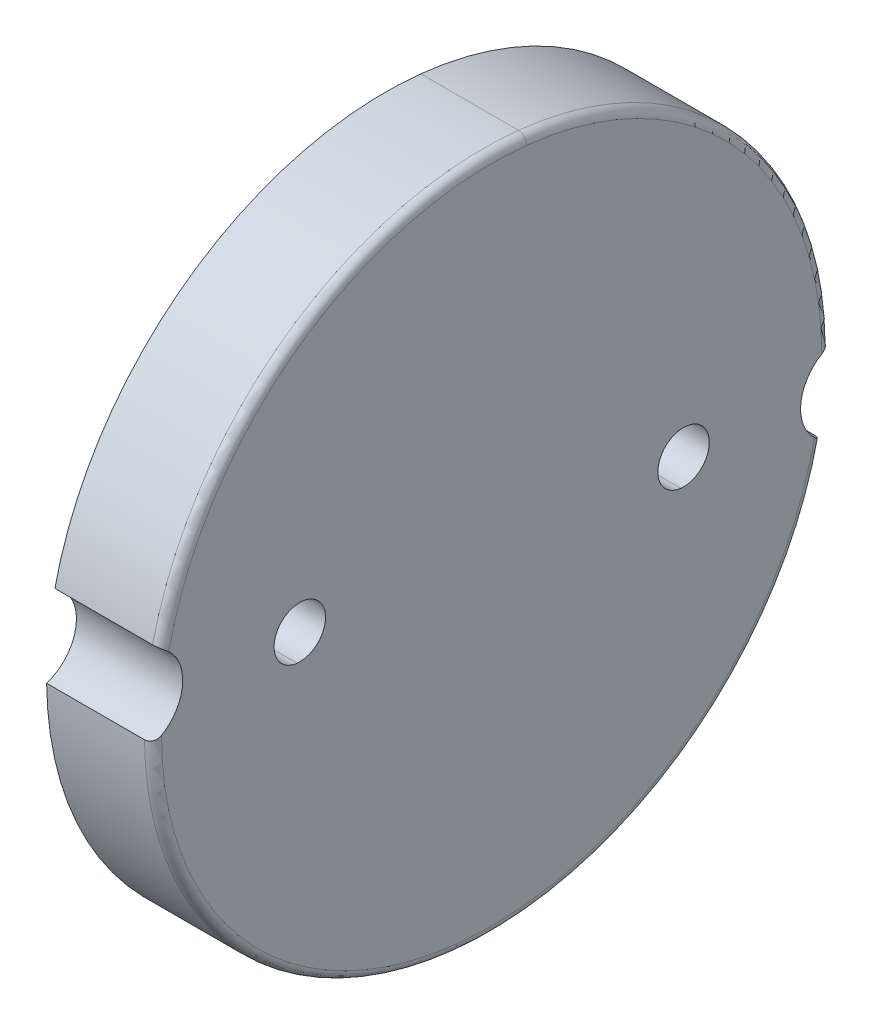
ISO-10303-21;
HEADER;
FILE_DESCRIPTION(('STEP AP214'),'2;1');
FILE_NAME('part.step','',(''),(''),'','','');
FILE_SCHEMA(('AUTOMOTIVE_DESIGN { 1 0 10303 214 1 1 1 1 }'));
ENDSEC;
DATA;
#1=APPLICATION_CONTEXT('core data for automotive mechanical design processes');
#2=APPLICATION_PROTOCOL_DEFINITION('international standard','automotive_design',2000,#1);
#3=PRODUCT_CONTEXT('',#1,'mechanical');
#4=PRODUCT('Part','Part','',(#3));
#5=PRODUCT_RELATED_PRODUCT_CATEGORY('part','',(#4));
#6=PRODUCT_DEFINITION_FORMATION('','',#4);
#7=PRODUCT_DEFINITION_CONTEXT('part definition',#1,'design');
#8=PRODUCT_DEFINITION('design','',#6,#7);
#9=PRODUCT_DEFINITION_SHAPE('','',#8);
#10=(LENGTH_UNIT() NAMED_UNIT(*) SI_UNIT(.MILLI.,.METRE.));
#11=(NAMED_UNIT(*) PLANE_ANGLE_UNIT() SI_UNIT($,.RADIAN.));
#12=(NAMED_UNIT(*) SI_UNIT($,.STERADIAN.) SOLID_ANGLE_UNIT());
#13=UNCERTAINTY_MEASURE_WITH_UNIT(LENGTH_MEASURE(1.E-05),#10,'distance_accuracy_value','');
#14=(GEOMETRIC_REPRESENTATION_CONTEXT(3) GLOBAL_UNCERTAINTY_ASSIGNED_CONTEXT((#13)) GLOBAL_UNIT_ASSIGNED_CONTEXT((#10,
#11,#12)) REPRESENTATION_CONTEXT('',''));
#15=CARTESIAN_POINT('',(0.,0.,0.));
#16=DIRECTION('',(0.,0.,1.));
#17=DIRECTION('',(1.,0.,0.));
#18=AXIS2_PLACEMENT_3D('',#15,#16,#17);
#19=CARTESIAN_POINT('',(77.46,-0.4703780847,-4.4753485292));
#20=DIRECTION('',(-1.,0.,0.));
#21=DIRECTION('',(0.,-0.994521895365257,0.104528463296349));
#22=AXIS2_PLACEMENT_3D('',#19,#20,#21);
#23=CYLINDRICAL_SURFACE('',#22,0.6);
#24=DIRECTION('',(1.,0.,0.));
#25=VECTOR('',#24,1.);
#26=CARTESIAN_POINT('',(83.61,-1.06709122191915,-4.41263145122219));
#27=LINE('',#26,#25);
#28=CARTESIAN_POINT('',(82.37,-1.06709122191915,-4.41263145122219));
#29=VERTEX_POINT('',#28);
#30=CARTESIAN_POINT('',(84.85,-1.06709122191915,-4.41263145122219));
#31=VERTEX_POINT('',#30);
#32=EDGE_CURVE('E41',#29,#31,#27,.T.);
#33=ORIENTED_EDGE('',*,*,#32,.F.);
#34=CARTESIAN_POINT('',(82.37,-0.4703780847,-4.4753485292));
#35=DIRECTION('',(1.,0.,0.));
#36=DIRECTION('',(0.,-0.994521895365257,0.104528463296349));
#37=AXIS2_PLACEMENT_3D('',#34,#35,#36);
#38=CIRCLE('',#37,0.6);
#39=CARTESIAN_POINT('',(82.37,0.126335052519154,-4.53806560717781));
#40=VERTEX_POINT('',#39);
#41=EDGE_CURVE('E212',#40,#29,#38,.T.);
#42=ORIENTED_EDGE('',*,*,#41,.F.);
#43=DIRECTION('',(-1.,0.,0.));
#44=VECTOR('',#43,1.);
#45=CARTESIAN_POINT('',(83.61,0.126335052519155,-4.53806560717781));
#46=LINE('',#45,#44);
#47=CARTESIAN_POINT('',(84.85,0.126335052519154,-4.53806560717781));
#48=VERTEX_POINT('',#47);
#49=EDGE_CURVE('E269',#48,#40,#46,.T.);
#50=ORIENTED_EDGE('',*,*,#49,.F.);
#51=CARTESIAN_POINT('',(84.85,-0.4703780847,-4.4753485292));
#52=DIRECTION('',(-1.,0.,0.));
#53=DIRECTION('',(0.,-0.994521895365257,0.104528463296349));
#54=AXIS2_PLACEMENT_3D('',#51,#52,#53);
#55=CIRCLE('',#54,0.6);
#56=EDGE_CURVE('E226',#31,#48,#55,.T.);
#57=ORIENTED_EDGE('',*,*,#56,.F.);
#58=EDGE_LOOP('',(#33,#42,#50,#57));
#59=FACE_BOUND('',#58,.T.);
#60=ADVANCED_FACE('F16',(#59),#23,.F.);
#61=CARTESIAN_POINT('',(77.46,0.4703780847,4.4753485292));
#62=DIRECTION('',(-1.,0.,0.));
#63=DIRECTION('',(0.,0.994521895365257,-0.104528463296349));
#64=AXIS2_PLACEMENT_3D('',#61,#62,#63);
#65=CYLINDRICAL_SURFACE('',#64,0.6);
#66=DIRECTION('',(1.,0.,0.));
#67=VECTOR('',#66,1.);
#68=CARTESIAN_POINT('',(83.61,1.06709122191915,4.41263145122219));
#69=LINE('',#68,#67);
#70=CARTESIAN_POINT('',(82.37,1.06709122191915,4.41263145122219));
#71=VERTEX_POINT('',#70);
#72=CARTESIAN_POINT('',(84.85,1.06709122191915,4.41263145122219));
#73=VERTEX_POINT('',#72);
#74=EDGE_CURVE('E220',#71,#73,#69,.T.);
#75=ORIENTED_EDGE('',*,*,#74,.F.);
#76=CARTESIAN_POINT('',(82.37,0.4703780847,4.4753485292));
#77=DIRECTION('',(1.,0.,0.));
#78=DIRECTION('',(0.,0.994521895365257,-0.104528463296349));
#79=AXIS2_PLACEMENT_3D('',#76,#77,#78);
#80=CIRCLE('',#79,0.6);
#81=CARTESIAN_POINT('',(82.37,-0.126335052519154,4.53806560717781));
#82=VERTEX_POINT('',#81);
#83=EDGE_CURVE('E213',#82,#71,#80,.T.);
#84=ORIENTED_EDGE('',*,*,#83,.F.);
#85=DIRECTION('',(-1.,0.,0.));
#86=VECTOR('',#85,1.);
#87=CARTESIAN_POINT('',(83.61,-0.126335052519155,4.53806560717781));
#88=LINE('',#87,#86);
#89=CARTESIAN_POINT('',(84.85,-0.126335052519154,4.53806560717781));
#90=VERTEX_POINT('',#89);
#91=EDGE_CURVE('E232',#90,#82,#88,.T.);
#92=ORIENTED_EDGE('',*,*,#91,.F.);
#93=CARTESIAN_POINT('',(84.85,0.4703780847,4.4753485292));
#94=DIRECTION('',(-1.,0.,0.));
#95=DIRECTION('',(0.,0.994521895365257,-0.104528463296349));
#96=AXIS2_PLACEMENT_3D('',#93,#94,#95);
#97=CIRCLE('',#96,0.6);
#98=EDGE_CURVE('E235',#73,#90,#97,.T.);
#99=ORIENTED_EDGE('',*,*,#98,.F.);
#100=EDGE_LOOP('',(#75,#84,#92,#99));
#101=FACE_BOUND('',#100,.T.);
#102=ADVANCED_FACE('F315',(#101),#65,.F.);
#103=CARTESIAN_POINT('',(84.6499999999,0.,0.));
#104=DIRECTION('',(-1.,0.,0.));
#105=DIRECTION('',(0.,-0.994521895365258,0.104528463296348));
#106=AXIS2_PLACEMENT_3D('',#103,#104,#105);
#107=TOROIDAL_SURFACE('',#106,7.6999999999,0.200000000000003);
#108=CARTESIAN_POINT('',(84.6499999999,-7.65781859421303,0.804869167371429));
#109=DIRECTION('',(0.,0.104528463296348,0.994521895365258));
#110=DIRECTION('',(0.,-0.994521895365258,0.104528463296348));
#111=AXIS2_PLACEMENT_3D('',#108,#109,#110);
#112=CIRCLE('',#111,0.200000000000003);
#113=CARTESIAN_POINT('',(84.6499999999,-7.85672297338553,0.825774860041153));
#114=VERTEX_POINT('',#113);
#115=CARTESIAN_POINT('',(84.85,-7.65781859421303,0.804869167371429));
#116=VERTEX_POINT('',#115);
#117=EDGE_CURVE('E258',#114,#116,#112,.T.);
#118=ORIENTED_EDGE('',*,*,#117,.F.);
#119=CARTESIAN_POINT('',(84.6499999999,0.,0.));
#120=DIRECTION('',(1.,0.,0.));
#121=DIRECTION('',(0.,-0.994521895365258,0.104528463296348));
#122=AXIS2_PLACEMENT_3D('',#119,#120,#121);
#123=CIRCLE('',#122,7.9);
#124=CARTESIAN_POINT('',(84.6499999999,-1.73032261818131,-7.70817641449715));
#125=VERTEX_POINT('',#124);
#126=EDGE_CURVE('E11',#114,#125,#123,.T.);
#127=ORIENTED_EDGE('',*,*,#126,.T.);
#128=CARTESIAN_POINT('',(84.65,-1.73032261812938,-7.70817641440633));
#129=CARTESIAN_POINT('',(84.65356289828,-1.7303226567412,-7.70817654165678));
#130=CARTESIAN_POINT('',(84.6571257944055,-1.73027416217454,-7.70808972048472));
#131=CARTESIAN_POINT('',(84.6642192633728,-1.73007993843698,-7.70774435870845));
#132=CARTESIAN_POINT('',(84.6677499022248,-1.72993479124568,-7.70748684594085));
#133=CARTESIAN_POINT('',(84.6747691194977,-1.72954822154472,-7.70680421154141));
#134=CARTESIAN_POINT('',(84.6782578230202,-1.72930735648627,-7.70638006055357));
#135=CARTESIAN_POINT('',(84.6851838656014,-1.72873049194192,-7.70536889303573));
#136=CARTESIAN_POINT('',(84.6886213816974,-1.72839502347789,-7.70478278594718));
#137=CARTESIAN_POINT('',(84.6954361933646,-1.72763019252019,-7.70345280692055));
#138=CARTESIAN_POINT('',(84.6988137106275,-1.72720133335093,-7.70270978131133));
#139=CARTESIAN_POINT('',(84.7055001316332,-1.72625107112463,-7.70107145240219));
#140=CARTESIAN_POINT('',(84.7088092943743,-1.72573014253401,-7.70017693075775));
#141=CARTESIAN_POINT('',(84.7153510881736,-1.72459718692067,-7.69824143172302));
#142=CARTESIAN_POINT('',(84.7185840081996,-1.72398560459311,-7.6972011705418));
#143=CARTESIAN_POINT('',(84.7249658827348,-1.72267287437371,-7.69498031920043));
#144=CARTESIAN_POINT('',(84.7281151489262,-1.72197214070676,-7.69380037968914));
#145=CARTESIAN_POINT('',(84.7343227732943,-1.72048271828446,-7.69130656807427));
#146=CARTESIAN_POINT('',(84.737381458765,-1.71969441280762,-7.6899932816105));
#147=CARTESIAN_POINT('',(84.7434014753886,-1.7180315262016,-7.6872394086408));
#148=CARTESIAN_POINT('',(84.7463631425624,-1.71715729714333,-7.6857993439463));
#149=CARTESIAN_POINT('',(84.7521831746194,-1.7153243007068,-7.68279875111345));
#150=CARTESIAN_POINT('',(84.7550418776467,-1.71436585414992,-7.6812386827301));
#151=CARTESIAN_POINT('',(84.7606505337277,-1.71236621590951,-7.67800508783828));
#152=CARTESIAN_POINT('',(84.7634008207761,-1.71132531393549,-7.67633196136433));
#153=CARTESIAN_POINT('',(84.7687876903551,-1.70916257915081,-7.67287940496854));
#154=CARTESIAN_POINT('',(84.7714245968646,-1.70804100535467,-7.67110031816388));
#155=CARTESIAN_POINT('',(84.7765802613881,-1.70571884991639,-7.66744307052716));
#156=CARTESIAN_POINT('',(84.7790993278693,-1.70451849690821,-7.66556519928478));
#157=CARTESIAN_POINT('',(84.7840152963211,-1.70204044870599,-7.6617178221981));
#158=CARTESIAN_POINT('',(84.7864124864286,-1.70076295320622,-7.65974855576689));
#159=CARTESIAN_POINT('',(84.7910813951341,-1.69813334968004,-7.65572539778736));
#160=CARTESIAN_POINT('',(84.7933533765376,-1.69678141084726,-7.65367170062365));
#161=CARTESIAN_POINT('',(84.7976884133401,-1.69405199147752,-7.64956410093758));
#162=CARTESIAN_POINT('',(84.7997561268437,-1.69267743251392,-7.64751317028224));
#163=CARTESIAN_POINT('',(84.8037882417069,-1.68984483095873,-7.64332845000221));
#164=CARTESIAN_POINT('',(84.8057516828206,-1.68838620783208,-7.64119412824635));
#165=CARTESIAN_POINT('',(84.8095704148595,-1.68538751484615,-7.6368465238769));
#166=CARTESIAN_POINT('',(84.8114246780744,-1.68384687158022,-7.63463273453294));
#167=CARTESIAN_POINT('',(84.8150201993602,-1.68068522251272,-7.63013078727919));
#168=CARTESIAN_POINT('',(84.8167603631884,-1.67906364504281,-7.62784215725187));
#169=CARTESIAN_POINT('',(84.8201230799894,-1.67574154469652,-7.62319524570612));
#170=CARTESIAN_POINT('',(84.8217444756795,-1.67404045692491,-7.62083653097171));
#171=CARTESIAN_POINT('',(84.8248652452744,-1.67056073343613,-7.61605443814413));
#172=CARTESIAN_POINT('',(84.8263634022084,-1.66878154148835,-7.61363067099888));
#173=CARTESIAN_POINT('',(84.8292335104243,-1.66514707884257,-7.60872368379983));
#174=CARTESIAN_POINT('',(84.8306041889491,-1.66329126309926,-7.6062401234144));
#175=CARTESIAN_POINT('',(84.8332153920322,-1.65950506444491,-7.60121898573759));
#176=CARTESIAN_POINT('',(84.8344545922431,-1.65757414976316,-7.59868112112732));
#177=CARTESIAN_POINT('',(84.8367991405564,-1.65363931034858,-7.59355702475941));
#178=CARTESIAN_POINT('',(84.8379031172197,-1.65163486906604,-7.59097056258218));
#179=CARTESIAN_POINT('',(84.8399737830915,-1.64755457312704,-7.58575512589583));
#180=CARTESIAN_POINT('',(84.8409390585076,-1.64547821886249,-7.58312598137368));
#181=CARTESIAN_POINT('',(84.8427291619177,-1.64125572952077,-7.57783122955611));
#182=CARTESIAN_POINT('',(84.8435525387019,-1.6391091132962,-7.57516551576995));
#183=CARTESIAN_POINT('',(84.8450559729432,-1.63474776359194,-7.56980385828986));
#184=CARTESIAN_POINT('',(84.8457345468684,-1.63253256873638,-7.56710787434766));
#185=CARTESIAN_POINT('',(84.8469458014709,-1.62803575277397,-7.56169208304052));
#186=CARTESIAN_POINT('',(84.8474769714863,-1.62575369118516,-7.55897230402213));
#187=CARTESIAN_POINT('',(84.8483911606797,-1.62112485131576,-7.553515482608));
#188=CARTESIAN_POINT('',(84.848772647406,-1.61877765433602,-7.5507785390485));
#189=CARTESIAN_POINT('',(84.8493855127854,-1.61402028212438,-7.54529411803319));
#190=CARTESIAN_POINT('',(84.8496153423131,-1.61160971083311,-7.54254681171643));
#191=CARTESIAN_POINT('',(84.8499233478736,-1.60672729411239,-7.53704844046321));
#192=CARTESIAN_POINT('',(84.8499999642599,-1.60425507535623,-7.53429761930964));
#193=CARTESIAN_POINT('',(84.8499999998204,-1.6017658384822,-7.5315624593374));
#194=B_SPLINE_CURVE_WITH_KNOTS('',3,(#128,#129,#130,#131,#132,#133,#134,#135,#136,#137,#138,
#139,#140,#141,#142,#143,#144,#145,#146,#147,#148,#149,#150,#151,#152,#153,#154,#155,#156,#157,
#158,#159,#160,#161,#162,#163,#164,#165,#166,#167,#168,#169,#170,#171,#172,#173,#174,#175,#176,
#177,#178,#179,#180,#181,#182,#183,#184,#185,#186,#187,#188,#189,#190,#191,#192,#193),
.UNSPECIFIED.,.F.,.F.,(4,2,2,2,2,2,2,2,2,2,2,2,2,2,2,2,2,2,2,2,2,2,2,2,2,2,2,2,2,2,2,2,4),(0.,
0.0106872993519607,0.0213108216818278,0.031873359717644,0.0423777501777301,0.0528268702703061,
0.0632236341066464,0.073570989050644,0.0838719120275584,0.0941294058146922,0.104346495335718,
0.114526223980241,0.124671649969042,0.134785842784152,0.144871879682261,0.154932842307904,
0.164971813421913,0.1746293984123,0.184364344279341,0.194179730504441,0.204078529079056,
0.214063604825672,0.224137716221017,0.234303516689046,0.244563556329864,0.254920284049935,
0.265376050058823,0.275933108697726,0.286593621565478,0.297359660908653,0.308233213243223,
0.319216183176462,0.330310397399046),.UNSPECIFIED.);
#195=CARTESIAN_POINT('',(84.85,-1.60177410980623,-7.53155493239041));
#196=VERTEX_POINT('',#195);
#197=EDGE_CURVE('E27',#125,#196,#194,.T.);
#198=ORIENTED_EDGE('',*,*,#197,.T.);
#199=CARTESIAN_POINT('',(84.85,0.,0.));
#200=DIRECTION('',(1.,0.,0.));
#201=DIRECTION('',(0.,0.,-1.));
#202=AXIS2_PLACEMENT_3D('',#199,#200,#201);
#203=CIRCLE('',#202,7.6999999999);
#204=EDGE_CURVE('E288',#116,#196,#203,.T.);
#205=ORIENTED_EDGE('',*,*,#204,.F.);
#206=EDGE_LOOP('',(#118,#127,#198,#205));
#207=FACE_BOUND('',#206,.T.);
#208=ADVANCED_FACE('F305',(#207),#107,.T.);
#209=CARTESIAN_POINT('',(83.61,0.,0.));
#210=DIRECTION('',(1.,0.,0.));
#211=DIRECTION('',(0.,-0.994521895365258,0.104528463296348));
#212=AXIS2_PLACEMENT_3D('',#209,#210,#211);
#213=CYLINDRICAL_SURFACE('',#212,7.9);
#214=DIRECTION('',(1.,0.,0.));
#215=VECTOR('',#214,1.);
#216=CARTESIAN_POINT('',(83.50999999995,-7.85672297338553,0.825774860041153));
#217=LINE('',#216,#215);
#218=CARTESIAN_POINT('',(82.37,-7.85672297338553,0.825774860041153));
#219=VERTEX_POINT('',#218);
#220=EDGE_CURVE('E174',#219,#114,#217,.T.);
#221=ORIENTED_EDGE('',*,*,#220,.F.);
#222=CARTESIAN_POINT('',(82.37,0.,0.));
#223=DIRECTION('',(-1.,0.,0.));
#224=DIRECTION('',(0.,-0.994521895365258,0.104528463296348));
#225=AXIS2_PLACEMENT_3D('',#222,#223,#224);
#226=CIRCLE('',#225,7.9);
#227=CARTESIAN_POINT('',(82.37,-1.73032261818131,-7.70817641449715));
#228=VERTEX_POINT('',#227);
#229=EDGE_CURVE('E168',#228,#219,#226,.T.);
#230=ORIENTED_EDGE('',*,*,#229,.F.);
#231=DIRECTION('',(1.,0.,0.));
#232=VECTOR('',#231,1.);
#233=CARTESIAN_POINT('',(83.61,-1.73032261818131,-7.70817641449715));
#234=LINE('',#233,#232);
#235=EDGE_CURVE('E172',#228,#125,#234,.T.);
#236=ORIENTED_EDGE('',*,*,#235,.T.);
#237=ORIENTED_EDGE('',*,*,#126,.F.);
#238=EDGE_LOOP('',(#221,#230,#236,#237));
#239=FACE_BOUND('',#238,.T.);
#240=ADVANCED_FACE('F170',(#239),#213,.T.);
#241=CARTESIAN_POINT('',(84.6499999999,0.,0.));
#242=DIRECTION('',(-1.,0.,0.));
#243=DIRECTION('',(0.,-0.994521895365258,0.104528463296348));
#244=AXIS2_PLACEMENT_3D('',#241,#242,#243);
#245=TOROIDAL_SURFACE('',#244,7.6999999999,0.200000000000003);
#246=CARTESIAN_POINT('',(84.6499999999,7.65781859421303,-0.804869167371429));
#247=DIRECTION('',(0.,0.104528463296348,0.994521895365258));
#248=DIRECTION('',(0.,0.994521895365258,-0.104528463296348));
#249=AXIS2_PLACEMENT_3D('',#246,#247,#248);
#250=CIRCLE('',#249,0.200000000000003);
#251=CARTESIAN_POINT('',(84.85,7.65781859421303,-0.804869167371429));
#252=VERTEX_POINT('',#251);
#253=CARTESIAN_POINT('',(84.6499999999,7.85672297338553,-0.825774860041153));
#254=VERTEX_POINT('',#253);
#255=EDGE_CURVE('E134',#252,#254,#250,.T.);
#256=ORIENTED_EDGE('',*,*,#255,.F.);
#257=CARTESIAN_POINT('',(84.85,0.,0.));
#258=DIRECTION('',(1.,0.,0.));
#259=DIRECTION('',(0.,0.,-1.));
#260=AXIS2_PLACEMENT_3D('',#257,#258,#259);
#261=CIRCLE('',#260,7.6999999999);
#262=CARTESIAN_POINT('',(84.85,0.000873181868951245,-7.69999995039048));
#263=VERTEX_POINT('',#262);
#264=EDGE_CURVE('E250',#263,#252,#261,.T.);
#265=ORIENTED_EDGE('',*,*,#264,.F.);
#266=CARTESIAN_POINT('',(84.65,-0.154545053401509,-7.49840755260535));
#267=CARTESIAN_POINT('',(84.6624727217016,-0.154545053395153,-7.49840755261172));
#268=CARTESIAN_POINT('',(84.6747854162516,-0.153353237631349,-7.49959634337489));
#269=CARTESIAN_POINT('',(84.6991895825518,-0.148742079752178,-7.50426245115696));
#270=CARTESIAN_POINT('',(84.711033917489,-0.145311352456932,-7.50775525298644));
#271=CARTESIAN_POINT('',(84.7459981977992,-0.132060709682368,-7.52155467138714));
#272=CARTESIAN_POINT('',(84.7667793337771,-0.119498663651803,-7.5350332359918));
#273=CARTESIAN_POINT('',(84.8068498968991,-0.0878160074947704,-7.57168673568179));
#274=CARTESIAN_POINT('',(84.8251840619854,-0.0666379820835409,-7.59801768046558));
#275=CARTESIAN_POINT('',(84.8467368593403,-0.026838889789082,-7.65441137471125));
#276=CARTESIAN_POINT('',(84.8514110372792,-0.00865005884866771,-7.68297684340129));
#277=CARTESIAN_POINT('',(84.8480828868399,0.0222163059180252,-7.73750252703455));
#278=CARTESIAN_POINT('',(84.8416907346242,0.0351545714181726,-7.76301885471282));
#279=CARTESIAN_POINT('',(84.8192148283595,0.0563812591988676,-7.80920261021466));
#280=CARTESIAN_POINT('',(84.8043000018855,0.0647415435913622,-7.82953729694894));
#281=CARTESIAN_POINT('',(84.7673584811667,0.0777309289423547,-7.86341911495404));
#282=CARTESIAN_POINT('',(84.7461364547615,0.0823447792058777,-7.87674225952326));
#283=CARTESIAN_POINT('',(84.6996282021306,0.0884313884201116,-7.89482853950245));
#284=CARTESIAN_POINT('',(84.674947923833,0.0898909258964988,-7.89948856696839));
#285=CARTESIAN_POINT('',(84.65,0.089890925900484,-7.89948856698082));
#286=(BOUNDED_CURVE() B_SPLINE_CURVE(3,(#266,#267,#268,#269,#270,#271,#272,#273,#274,#275,#276,
#277,#278,#279,#280,#281,#282,#283,#284,#285),.UNSPECIFIED.,.F.,
.F.) B_SPLINE_CURVE_WITH_KNOTS((4,2,2,2,2,2,2,2,2,4),(-0.702521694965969,-0.662050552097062,
-0.620526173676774,-0.532745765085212,-0.417264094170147,-0.316989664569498,-0.23000118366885,
-0.150779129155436,-0.0748437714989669,0.),
.UNSPECIFIED.) CURVE() GEOMETRIC_REPRESENTATION_ITEM() RATIONAL_B_SPLINE_CURVE((1.,1.,1.,1.,1.,
1.,1.,1.,1.,1.,1.,1.,1.,1.,1.,1.,1.,1.,1.,1.)) REPRESENTATION_ITEM(''));
#287=CARTESIAN_POINT('',(84.6499999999,0.0898909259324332,-7.89948856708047));
#288=VERTEX_POINT('',#287);
#289=EDGE_CURVE('E189',#263,#288,#286,.T.);
#290=ORIENTED_EDGE('',*,*,#289,.T.);
#291=CARTESIAN_POINT('',(84.6499999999,0.,0.));
#292=DIRECTION('',(1.,0.,0.));
#293=DIRECTION('',(0.,-0.994521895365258,0.104528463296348));
#294=AXIS2_PLACEMENT_3D('',#291,#292,#293);
#295=CIRCLE('',#294,7.9);
#296=EDGE_CURVE('E125',#288,#254,#295,.T.);
#297=ORIENTED_EDGE('',*,*,#296,.T.);
#298=EDGE_LOOP('',(#256,#265,#290,#297));
#299=FACE_BOUND('',#298,.T.);
#300=ADVANCED_FACE('F328',(#299),#245,.T.);
#301=CARTESIAN_POINT('',(83.61,0.,0.));
#302=DIRECTION('',(1.,0.,0.));
#303=DIRECTION('',(0.,-0.994521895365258,0.104528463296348));
#304=AXIS2_PLACEMENT_3D('',#301,#302,#303);
#305=CYLINDRICAL_SURFACE('',#304,7.9);
#306=DIRECTION('',(-1.,0.,0.));
#307=VECTOR('',#306,1.);
#308=CARTESIAN_POINT('',(83.50999999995,7.85672297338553,-0.825774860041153));
#309=LINE('',#308,#307);
#310=CARTESIAN_POINT('',(82.37,7.85672297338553,-0.825774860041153));
#311=VERTEX_POINT('',#310);
#312=EDGE_CURVE('E221',#254,#311,#309,.T.);
#313=ORIENTED_EDGE('',*,*,#312,.F.);
#314=ORIENTED_EDGE('',*,*,#296,.F.);
#315=DIRECTION('',(-1.,0.,0.));
#316=VECTOR('',#315,1.);
#317=CARTESIAN_POINT('',(83.61,0.0898909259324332,-7.89948856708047));
#318=LINE('',#317,#316);
#319=CARTESIAN_POINT('',(82.37,0.0898909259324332,-7.89948856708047));
#320=VERTEX_POINT('',#319);
#321=EDGE_CURVE('E259',#288,#320,#318,.T.);
#322=ORIENTED_EDGE('',*,*,#321,.T.);
#323=CARTESIAN_POINT('',(82.37,0.,0.));
#324=DIRECTION('',(-1.,0.,0.));
#325=DIRECTION('',(0.,-0.994521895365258,0.104528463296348));
#326=AXIS2_PLACEMENT_3D('',#323,#324,#325);
#327=CIRCLE('',#326,7.9);
#328=EDGE_CURVE('E145',#311,#320,#327,.T.);
#329=ORIENTED_EDGE('',*,*,#328,.F.);
#330=EDGE_LOOP('',(#313,#314,#322,#329));
#331=FACE_BOUND('',#330,.T.);
#332=ADVANCED_FACE('F347',(#331),#305,.T.);
#333=CARTESIAN_POINT('',(83.61,0.862359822,8.2048056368));
#334=DIRECTION('',(1.,0.,0.));
#335=DIRECTION('',(0.,0.994521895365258,-0.104528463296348));
#336=AXIS2_PLACEMENT_3D('',#333,#334,#335);
#337=CYLINDRICAL_SURFACE('',#336,1.);
#338=DIRECTION('',(-1.,0.,0.));
#339=VECTOR('',#338,1.);
#340=CARTESIAN_POINT('',(83.61,-0.0898909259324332,7.89948856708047));
#341=LINE('',#340,#339);
#342=CARTESIAN_POINT('',(84.6499999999,-0.0898909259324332,7.89948856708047));
#343=VERTEX_POINT('',#342);
#344=CARTESIAN_POINT('',(82.37,-0.0898909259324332,7.89948856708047));
#345=VERTEX_POINT('',#344);
#346=EDGE_CURVE('E206',#343,#345,#341,.T.);
#347=ORIENTED_EDGE('',*,*,#346,.F.);
#348=CARTESIAN_POINT('',(84.649978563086,0.154545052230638,7.49840755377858));
#349=CARTESIAN_POINT('',(84.6624554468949,0.154546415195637,7.49840618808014));
#350=CARTESIAN_POINT('',(84.674772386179,0.153355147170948,7.49959442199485));
#351=CARTESIAN_POINT('',(84.6991851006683,0.148743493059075,7.5042610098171));
#352=CARTESIAN_POINT('',(84.7110334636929,0.14531172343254,7.5077548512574));
#353=CARTESIAN_POINT('',(84.7460092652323,0.132056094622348,7.52155951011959));
#354=CARTESIAN_POINT('',(84.7667962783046,0.119488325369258,7.5350444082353));
#355=CARTESIAN_POINT('',(84.8068669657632,0.087798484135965,7.5717080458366));
#356=CARTESIAN_POINT('',(84.8251974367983,0.0666202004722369,7.5980409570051));
#357=CARTESIAN_POINT('',(84.8467424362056,0.0268225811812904,7.65443615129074));
#358=CARTESIAN_POINT('',(84.8514129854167,0.00863523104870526,7.6830012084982));
#359=CARTESIAN_POINT('',(84.8480785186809,-0.022228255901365,7.73752522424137));
#360=CARTESIAN_POINT('',(84.8416835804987,-0.0351650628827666,7.76304030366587));
#361=CARTESIAN_POINT('',(84.8192028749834,-0.0563891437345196,7.80922102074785));
#362=CARTESIAN_POINT('',(84.8042859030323,-0.064748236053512,7.82955395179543));
#363=CARTESIAN_POINT('',(84.7673408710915,-0.0777354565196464,7.86343169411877));
#364=CARTESIAN_POINT('',(84.7461173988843,-0.0823483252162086,7.87675254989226));
#365=CARTESIAN_POINT('',(84.6996072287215,-0.0884330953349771,7.89483385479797));
#366=CARTESIAN_POINT('',(84.6749264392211,-0.0898917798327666,7.89949123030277));
#367=CARTESIAN_POINT('',(84.649978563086,-0.0898909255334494,7.89948856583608));
#368=(BOUNDED_CURVE() B_SPLINE_CURVE(3,(#348,#349,#350,#351,#352,#353,#354,#355,#356,#357,#358,
#359,#360,#361,#362,#363,#364,#365,#366,#367),.UNSPECIFIED.,.F.,
.F.) B_SPLINE_CURVE_WITH_KNOTS((4,2,2,2,2,2,2,2,2,4),(-0.702565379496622,-0.662081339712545,
-0.620543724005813,-0.532734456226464,-0.417254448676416,-0.316984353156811,-0.22999899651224,
-0.15077843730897,-0.074843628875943,0.),
.UNSPECIFIED.) CURVE() GEOMETRIC_REPRESENTATION_ITEM() RATIONAL_B_SPLINE_CURVE((1.,1.,1.,1.,1.,
1.,1.,1.,1.,1.,1.,1.,1.,1.,1.,1.,1.,1.,1.,1.)) REPRESENTATION_ITEM(''));
#369=CARTESIAN_POINT('',(84.85,-0.000873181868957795,7.69999995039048));
#370=VERTEX_POINT('',#369);
#371=EDGE_CURVE('E219',#370,#343,#368,.T.);
#372=ORIENTED_EDGE('',*,*,#371,.F.);
#373=CARTESIAN_POINT('',(84.85,0.862359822,8.2048056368));
#374=DIRECTION('',(-1.,0.,0.));
#375=DIRECTION('',(0.,0.994521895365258,-0.104528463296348));
#376=AXIS2_PLACEMENT_3D('',#373,#374,#375);
#377=CIRCLE('',#376,1.);
#378=CARTESIAN_POINT('',(84.85,1.60177410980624,7.53155493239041));
#379=VERTEX_POINT('',#378);
#380=EDGE_CURVE('E65',#379,#370,#377,.T.);
#381=ORIENTED_EDGE('',*,*,#380,.F.);
#382=CARTESIAN_POINT('',(84.6499999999,1.73032261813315,7.70817641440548));
#383=CARTESIAN_POINT('',(84.6535628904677,1.73032265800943,7.7081765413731));
#384=CARTESIAN_POINT('',(84.6571257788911,1.73027416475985,7.70808972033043));
#385=CARTESIAN_POINT('',(84.6642192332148,1.73007994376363,7.70774435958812));
#386=CARTESIAN_POINT('',(84.6677498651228,1.72993479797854,7.70748684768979));
#387=CARTESIAN_POINT('',(84.6747690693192,1.72954823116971,7.70680421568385));
#388=CARTESIAN_POINT('',(84.6782577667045,1.72930736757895,7.70638006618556));
#389=CARTESIAN_POINT('',(84.6851837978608,1.72873050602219,7.70536890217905));
#390=CARTESIAN_POINT('',(84.6886213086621,1.72839503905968,7.7047827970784));
#391=CARTESIAN_POINT('',(84.6954361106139,1.72763021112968,7.70345282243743));
#392=CARTESIAN_POINT('',(84.6988136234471,1.72720135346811,7.70270979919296));
#393=CARTESIAN_POINT('',(84.705500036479,1.72625109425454,7.70107147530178));
#394=CARTESIAN_POINT('',(84.7088091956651,1.72573016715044,7.70017695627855));
#395=CARTESIAN_POINT('',(84.7153509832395,1.72459721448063,7.69824146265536));
#396=CARTESIAN_POINT('',(84.7185839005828,1.72398563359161,7.6972012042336));
#397=CARTESIAN_POINT('',(84.7249657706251,1.72267290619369,7.69498035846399));
#398=CARTESIAN_POINT('',(84.7281150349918,1.72197217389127,7.69380042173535));
#399=CARTESIAN_POINT('',(84.7343226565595,1.72048275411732,7.69130661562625));
#400=CARTESIAN_POINT('',(84.7373813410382,1.719694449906,7.68999333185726));
#401=CARTESIAN_POINT('',(84.7434013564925,1.71803156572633,7.68723946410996));
#402=CARTESIAN_POINT('',(84.7463630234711,1.71715733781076,7.68579940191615));
#403=CARTESIAN_POINT('',(84.7521830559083,1.7153243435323,7.68279881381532));
#404=CARTESIAN_POINT('',(84.7550417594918,1.71436589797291,7.68123874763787));
#405=CARTESIAN_POINT('',(84.7606504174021,1.71236626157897,7.67800515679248));
#406=CARTESIAN_POINT('',(84.7634007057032,1.71132536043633,7.67633203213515));
#407=CARTESIAN_POINT('',(84.768787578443,1.70916262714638,7.67287947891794));
#408=CARTESIAN_POINT('',(84.7714244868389,1.70804105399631,7.67110039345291));
#409=CARTESIAN_POINT('',(84.776580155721,1.70571889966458,7.66744314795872));
#410=CARTESIAN_POINT('',(84.7790992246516,1.7045185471,7.66556527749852));
#411=CARTESIAN_POINT('',(84.784015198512,1.70204049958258,7.66171790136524));
#412=CARTESIAN_POINT('',(84.786412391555,1.70076300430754,7.65974863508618));
#413=CARTESIAN_POINT('',(84.7910813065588,1.69813340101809,7.65572547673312));
#414=CARTESIAN_POINT('',(84.7933532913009,1.69678146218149,7.65367177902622));
#415=CARTESIAN_POINT('',(84.7976883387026,1.69405204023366,7.64956417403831));
#416=CARTESIAN_POINT('',(84.7997560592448,1.69267747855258,7.64751323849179));
#417=CARTESIAN_POINT('',(84.8037881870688,1.68984487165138,7.6433285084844));
#418=CARTESIAN_POINT('',(84.8057516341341,1.68838624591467,7.64119418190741));
#419=CARTESIAN_POINT('',(84.8095703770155,1.68538754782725,7.63684656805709));
#420=CARTESIAN_POINT('',(84.8114246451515,1.68384690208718,7.63463277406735));
#421=CARTESIAN_POINT('',(84.8150201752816,1.68068524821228,7.63013081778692));
#422=CARTESIAN_POINT('',(84.8167603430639,1.67906366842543,7.62784218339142));
#423=CARTESIAN_POINT('',(84.8201230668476,1.6757415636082,7.62319526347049));
#424=CARTESIAN_POINT('',(84.8217444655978,1.67404047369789,7.62083654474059));
#425=CARTESIAN_POINT('',(84.8248652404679,1.67056074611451,7.61605444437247));
#426=CARTESIAN_POINT('',(84.8263633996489,1.66878155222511,7.61363067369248));
#427=CARTESIAN_POINT('',(84.8292335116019,1.66514708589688,7.60872367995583));
#428=CARTESIAN_POINT('',(84.8306041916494,1.663291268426,7.60624011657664));
#429=CARTESIAN_POINT('',(84.833215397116,1.65950506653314,7.60121897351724));
#430=CARTESIAN_POINT('',(84.8344545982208,1.65757415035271,7.59868110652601));
#431=CARTESIAN_POINT('',(84.8367991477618,1.65363930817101,7.59355700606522));
#432=CARTESIAN_POINT('',(84.8379031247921,1.6516348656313,7.59097054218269));
#433=CARTESIAN_POINT('',(84.8399737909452,1.64755456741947,7.58575510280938));
#434=CARTESIAN_POINT('',(84.8409390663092,1.64547821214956,7.58312595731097));
#435=CARTESIAN_POINT('',(84.8427291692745,1.64125572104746,7.57783120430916));
#436=CARTESIAN_POINT('',(84.8435525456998,1.63910910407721,7.57516549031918));
#437=CARTESIAN_POINT('',(84.8450559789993,1.63474775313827,7.56980383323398));
#438=CARTESIAN_POINT('',(84.8457345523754,1.63253255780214,7.56710784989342));
#439=CARTESIAN_POINT('',(84.8469458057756,1.62803574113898,7.5616920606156));
#440=CARTESIAN_POINT('',(84.8474769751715,1.62575367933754,7.55897228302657));
#441=CARTESIAN_POINT('',(84.8483911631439,1.62112483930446,7.5535154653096));
#442=CARTESIAN_POINT('',(84.8487726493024,1.61877764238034,7.5507785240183));
#443=CARTESIAN_POINT('',(84.8493855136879,1.61402027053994,7.54529410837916));
#444=CARTESIAN_POINT('',(84.8496153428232,1.61160969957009,7.54254680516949));
#445=CARTESIAN_POINT('',(84.849923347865,1.60672728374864,7.53704844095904));
#446=CARTESIAN_POINT('',(84.8499999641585,1.60425506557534,7.53429762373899));
#447=CARTESIAN_POINT('',(84.8499999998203,1.60176582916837,7.53156246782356));
#448=B_SPLINE_CURVE_WITH_KNOTS('',3,(#382,#383,#384,#385,#386,#387,#388,#389,#390,#391,#392,
#393,#394,#395,#396,#397,#398,#399,#400,#401,#402,#403,#404,#405,#406,#407,#408,#409,#410,#411,
#412,#413,#414,#415,#416,#417,#418,#419,#420,#421,#422,#423,#424,#425,#426,#427,#428,#429,#430,
#431,#432,#433,#434,#435,#436,#437,#438,#439,#440,#441,#442,#443,#444,#445,#446,#447),
.UNSPECIFIED.,.F.,.F.,(4,2,2,2,2,2,2,2,2,2,2,2,2,2,2,2,2,2,2,2,2,2,2,2,2,2,2,2,2,2,2,2,4),(0.,
0.0106872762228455,0.0213107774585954,0.0318732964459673,0.0423776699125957,0.0528267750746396,
0.0632235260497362,0.0735708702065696,0.0838717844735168,0.0941292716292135,0.104346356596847,
0.114526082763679,0.124671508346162,0.134785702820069,0.14487174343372,0.154932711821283,
0.164971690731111,0.174629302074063,0.184364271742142,0.194179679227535,0.204078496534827,
0.214063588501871,0.224137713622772,0.234303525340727,0.24456357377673,0.254920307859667,
0.265376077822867,0.275933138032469,0.286593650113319,0.29735968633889,0.308233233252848,
0.319216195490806,0.330310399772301),.UNSPECIFIED.);
#449=CARTESIAN_POINT('',(84.6499999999,1.73032261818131,7.70817641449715));
#450=VERTEX_POINT('',#449);
#451=EDGE_CURVE('E75',#450,#379,#448,.T.);
#452=ORIENTED_EDGE('',*,*,#451,.F.);
#453=DIRECTION('',(1.,0.,0.));
#454=VECTOR('',#453,1.);
#455=CARTESIAN_POINT('',(83.61,1.73032261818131,7.70817641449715));
#456=LINE('',#455,#454);
#457=CARTESIAN_POINT('',(82.37,1.73032261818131,7.70817641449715));
#458=VERTEX_POINT('',#457);
#459=EDGE_CURVE('E225',#458,#450,#456,.T.);
#460=ORIENTED_EDGE('',*,*,#459,.F.);
#461=CARTESIAN_POINT('',(82.37,0.862359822,8.2048056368));
#462=DIRECTION('',(1.,0.,0.));
#463=DIRECTION('',(0.,0.994521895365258,-0.104528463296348));
#464=AXIS2_PLACEMENT_3D('',#461,#462,#463);
#465=CIRCLE('',#464,1.);
#466=EDGE_CURVE('E249',#345,#458,#465,.T.);
#467=ORIENTED_EDGE('',*,*,#466,.F.);
#468=EDGE_LOOP('',(#347,#372,#381,#452,#460,#467));
#469=FACE_BOUND('',#468,.T.);
#470=ADVANCED_FACE('F332',(#469),#337,.F.);
#471=CARTESIAN_POINT('',(82.37,0.,0.));
#472=DIRECTION('',(-1.,0.,0.));
#473=DIRECTION('',(0.,0.,1.));
#474=AXIS2_PLACEMENT_3D('',#471,#472,#473);
#475=PLANE('',#474);
#476=ORIENTED_EDGE('',*,*,#466,.T.);
#477=CARTESIAN_POINT('',(82.37,0.,0.));
#478=DIRECTION('',(-1.,0.,0.));
#479=DIRECTION('',(0.,-0.994521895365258,0.104528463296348));
#480=AXIS2_PLACEMENT_3D('',#477,#478,#479);
#481=CIRCLE('',#480,7.9);
#482=EDGE_CURVE('E200',#458,#311,#481,.T.);
#483=ORIENTED_EDGE('',*,*,#482,.T.);
#484=ORIENTED_EDGE('',*,*,#328,.T.);
#485=CARTESIAN_POINT('',(82.37,-0.862359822,-8.2048056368));
#486=DIRECTION('',(1.,0.,0.));
#487=DIRECTION('',(0.,-0.994521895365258,0.104528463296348));
#488=AXIS2_PLACEMENT_3D('',#485,#486,#487);
#489=CIRCLE('',#488,1.);
#490=EDGE_CURVE('E178',#320,#228,#489,.T.);
#491=ORIENTED_EDGE('',*,*,#490,.T.);
#492=ORIENTED_EDGE('',*,*,#229,.T.);
#493=CARTESIAN_POINT('',(82.37,0.,0.));
#494=DIRECTION('',(-1.,0.,0.));
#495=DIRECTION('',(0.,-0.994521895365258,0.104528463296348));
#496=AXIS2_PLACEMENT_3D('',#493,#494,#495);
#497=CIRCLE('',#496,7.9);
#498=EDGE_CURVE('E179',#219,#345,#497,.T.);
#499=ORIENTED_EDGE('',*,*,#498,.T.);
#500=EDGE_LOOP('',(#476,#483,#484,#491,#492,#499));
#501=FACE_BOUND('',#500,.T.);
#502=ORIENTED_EDGE('',*,*,#41,.T.);
#503=CARTESIAN_POINT('',(82.37,-0.4703780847,-4.4753485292));
#504=DIRECTION('',(1.,0.,0.));
#505=DIRECTION('',(0.,-0.994521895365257,0.104528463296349));
#506=AXIS2_PLACEMENT_3D('',#503,#504,#505);
#507=CIRCLE('',#506,0.6);
#508=EDGE_CURVE('E209',#29,#40,#507,.T.);
#509=ORIENTED_EDGE('',*,*,#508,.T.);
#510=EDGE_LOOP('',(#502,#509));
#511=FACE_BOUND('',#510,.T.);
#512=ORIENTED_EDGE('',*,*,#83,.T.);
#513=CARTESIAN_POINT('',(82.37,0.4703780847,4.4753485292));
#514=DIRECTION('',(1.,0.,0.));
#515=DIRECTION('',(0.,0.994521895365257,-0.104528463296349));
#516=AXIS2_PLACEMENT_3D('',#513,#514,#515);
#517=CIRCLE('',#516,0.6);
#518=EDGE_CURVE('E224',#71,#82,#517,.T.);
#519=ORIENTED_EDGE('',*,*,#518,.T.);
#520=EDGE_LOOP('',(#512,#519));
#521=FACE_BOUND('',#520,.T.);
#522=ADVANCED_FACE('F192',(#501,#511,#521),#475,.T.);
#523=CARTESIAN_POINT('',(83.61,0.,0.));
#524=DIRECTION('',(1.,0.,0.));
#525=DIRECTION('',(0.,-0.994521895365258,0.104528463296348));
#526=AXIS2_PLACEMENT_3D('',#523,#524,#525);
#527=CYLINDRICAL_SURFACE('',#526,7.9);
#528=ORIENTED_EDGE('',*,*,#312,.T.);
#529=ORIENTED_EDGE('',*,*,#482,.F.);
#530=ORIENTED_EDGE('',*,*,#459,.T.);
#531=CARTESIAN_POINT('',(84.6499999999,0.,0.));
#532=DIRECTION('',(1.,0.,0.));
#533=DIRECTION('',(0.,-0.994521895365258,0.104528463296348));
#534=AXIS2_PLACEMENT_3D('',#531,#532,#533);
#535=CIRCLE('',#534,7.9);
#536=EDGE_CURVE('E480',#254,#450,#535,.T.);
#537=ORIENTED_EDGE('',*,*,#536,.F.);
#538=EDGE_LOOP('',(#528,#529,#530,#537));
#539=FACE_BOUND('',#538,.T.);
#540=ADVANCED_FACE('F331',(#539),#527,.T.);
#541=CARTESIAN_POINT('',(84.6499999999,0.,0.));
#542=DIRECTION('',(-1.,0.,0.));
#543=DIRECTION('',(0.,-0.994521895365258,0.104528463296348));
#544=AXIS2_PLACEMENT_3D('',#541,#542,#543);
#545=TOROIDAL_SURFACE('',#544,7.6999999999,0.200000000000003);
#546=ORIENTED_EDGE('',*,*,#255,.T.);
#547=ORIENTED_EDGE('',*,*,#536,.T.);
#548=ORIENTED_EDGE('',*,*,#451,.T.);
#549=CARTESIAN_POINT('',(84.85,0.,0.));
#550=DIRECTION('',(1.,0.,0.));
#551=DIRECTION('',(0.,0.,-1.));
#552=AXIS2_PLACEMENT_3D('',#549,#550,#551);
#553=CIRCLE('',#552,7.6999999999);
#554=EDGE_CURVE('E230',#252,#379,#553,.T.);
#555=ORIENTED_EDGE('',*,*,#554,.F.);
#556=EDGE_LOOP('',(#546,#547,#548,#555));
#557=FACE_BOUND('',#556,.T.);
#558=ADVANCED_FACE('F343',(#557),#545,.T.);
#559=CARTESIAN_POINT('',(83.61,-0.862359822,-8.2048056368));
#560=DIRECTION('',(1.,0.,0.));
#561=DIRECTION('',(0.,-0.994521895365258,0.104528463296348));
#562=AXIS2_PLACEMENT_3D('',#559,#560,#561);
#563=CYLINDRICAL_SURFACE('',#562,1.);
#564=ORIENTED_EDGE('',*,*,#235,.F.);
#565=ORIENTED_EDGE('',*,*,#490,.F.);
#566=ORIENTED_EDGE('',*,*,#321,.F.);
#567=ORIENTED_EDGE('',*,*,#289,.F.);
#568=CARTESIAN_POINT('',(84.85,-0.862359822,-8.2048056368));
#569=DIRECTION('',(-1.,0.,0.));
#570=DIRECTION('',(0.,-0.994521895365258,0.104528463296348));
#571=AXIS2_PLACEMENT_3D('',#568,#569,#570);
#572=CIRCLE('',#571,1.);
#573=EDGE_CURVE('E252',#196,#263,#572,.T.);
#574=ORIENTED_EDGE('',*,*,#573,.F.);
#575=ORIENTED_EDGE('',*,*,#197,.F.);
#576=EDGE_LOOP('',(#564,#565,#566,#567,#574,#575));
#577=FACE_BOUND('',#576,.T.);
#578=ADVANCED_FACE('F183',(#577),#563,.F.);
#579=CARTESIAN_POINT('',(83.61,0.,0.));
#580=DIRECTION('',(1.,0.,0.));
#581=DIRECTION('',(0.,-0.994521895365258,0.104528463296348));
#582=AXIS2_PLACEMENT_3D('',#579,#580,#581);
#583=CYLINDRICAL_SURFACE('',#582,7.9);
#584=ORIENTED_EDGE('',*,*,#220,.T.);
#585=CARTESIAN_POINT('',(84.6499999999,0.,0.));
#586=DIRECTION('',(1.,0.,0.));
#587=DIRECTION('',(0.,-0.994521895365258,0.104528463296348));
#588=AXIS2_PLACEMENT_3D('',#585,#586,#587);
#589=CIRCLE('',#588,7.9);
#590=EDGE_CURVE('E215',#343,#114,#589,.T.);
#591=ORIENTED_EDGE('',*,*,#590,.F.);
#592=ORIENTED_EDGE('',*,*,#346,.T.);
#593=ORIENTED_EDGE('',*,*,#498,.F.);
#594=EDGE_LOOP('',(#584,#591,#592,#593));
#595=FACE_BOUND('',#594,.T.);
#596=ADVANCED_FACE('F321',(#595),#583,.T.);
#597=CARTESIAN_POINT('',(84.85,0.,0.));
#598=DIRECTION('',(1.,0.,0.));
#599=DIRECTION('',(0.,1.,0.));
#600=AXIS2_PLACEMENT_3D('',#597,#598,#599);
#601=PLANE('',#600);
#602=ORIENTED_EDGE('',*,*,#380,.T.);
#603=CARTESIAN_POINT('',(84.85,0.,0.));
#604=DIRECTION('',(1.,0.,0.));
#605=DIRECTION('',(0.,0.,-1.));
#606=AXIS2_PLACEMENT_3D('',#603,#604,#605);
#607=CIRCLE('',#606,7.6999999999);
#608=EDGE_CURVE('E204',#370,#116,#607,.T.);
#609=ORIENTED_EDGE('',*,*,#608,.T.);
#610=ORIENTED_EDGE('',*,*,#204,.T.);
#611=ORIENTED_EDGE('',*,*,#573,.T.);
#612=ORIENTED_EDGE('',*,*,#264,.T.);
#613=ORIENTED_EDGE('',*,*,#554,.T.);
#614=EDGE_LOOP('',(#602,#609,#610,#611,#612,#613));
#615=FACE_BOUND('',#614,.T.);
#616=ORIENTED_EDGE('',*,*,#56,.T.);
#617=CARTESIAN_POINT('',(84.85,-0.4703780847,-4.4753485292));
#618=DIRECTION('',(-1.,0.,0.));
#619=DIRECTION('',(0.,-0.994521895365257,0.104528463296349));
#620=AXIS2_PLACEMENT_3D('',#617,#618,#619);
#621=CIRCLE('',#620,0.6);
#622=EDGE_CURVE('E231',#48,#31,#621,.T.);
#623=ORIENTED_EDGE('',*,*,#622,.T.);
#624=EDGE_LOOP('',(#616,#623));
#625=FACE_BOUND('',#624,.T.);
#626=ORIENTED_EDGE('',*,*,#98,.T.);
#627=CARTESIAN_POINT('',(84.85,0.4703780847,4.4753485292));
#628=DIRECTION('',(-1.,0.,0.));
#629=DIRECTION('',(0.,0.994521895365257,-0.104528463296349));
#630=AXIS2_PLACEMENT_3D('',#627,#628,#629);
#631=CIRCLE('',#630,0.6);
#632=EDGE_CURVE('E239',#90,#73,#631,.T.);
#633=ORIENTED_EDGE('',*,*,#632,.T.);
#634=EDGE_LOOP('',(#626,#633));
#635=FACE_BOUND('',#634,.T.);
#636=ADVANCED_FACE('F324',(#615,#625,#635),#601,.T.);
#637=CARTESIAN_POINT('',(84.6499999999,0.,0.));
#638=DIRECTION('',(-1.,0.,0.));
#639=DIRECTION('',(0.,-0.994521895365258,0.104528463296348));
#640=AXIS2_PLACEMENT_3D('',#637,#638,#639);
#641=TOROIDAL_SURFACE('',#640,7.6999999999,0.200000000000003);
#642=ORIENTED_EDGE('',*,*,#117,.T.);
#643=ORIENTED_EDGE('',*,*,#608,.F.);
#644=ORIENTED_EDGE('',*,*,#371,.T.);
#645=ORIENTED_EDGE('',*,*,#590,.T.);
#646=EDGE_LOOP('',(#642,#643,#644,#645));
#647=FACE_BOUND('',#646,.T.);
#648=ADVANCED_FACE('F335',(#647),#641,.T.);
#649=CARTESIAN_POINT('',(77.46,0.4703780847,4.4753485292));
#650=DIRECTION('',(-1.,0.,0.));
#651=DIRECTION('',(0.,0.994521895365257,-0.104528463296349));
#652=AXIS2_PLACEMENT_3D('',#649,#650,#651);
#653=CYLINDRICAL_SURFACE('',#652,0.6);
#654=ORIENTED_EDGE('',*,*,#74,.T.);
#655=ORIENTED_EDGE('',*,*,#632,.F.);
#656=ORIENTED_EDGE('',*,*,#91,.T.);
#657=ORIENTED_EDGE('',*,*,#518,.F.);
#658=EDGE_LOOP('',(#654,#655,#656,#657));
#659=FACE_BOUND('',#658,.T.);
#660=ADVANCED_FACE('F337',(#659),#653,.F.);
#661=CARTESIAN_POINT('',(77.46,-0.4703780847,-4.4753485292));
#662=DIRECTION('',(-1.,0.,0.));
#663=DIRECTION('',(0.,-0.994521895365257,0.104528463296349));
#664=AXIS2_PLACEMENT_3D('',#661,#662,#663);
#665=CYLINDRICAL_SURFACE('',#664,0.6);
#666=ORIENTED_EDGE('',*,*,#32,.T.);
#667=ORIENTED_EDGE('',*,*,#622,.F.);
#668=ORIENTED_EDGE('',*,*,#49,.T.);
#669=ORIENTED_EDGE('',*,*,#508,.F.);
#670=EDGE_LOOP('',(#666,#667,#668,#669));
#671=FACE_BOUND('',#670,.T.);
#672=ADVANCED_FACE('F18',(#671),#665,.F.);
#673=CLOSED_SHELL('',(#60,#102,#208,#240,#300,#332,#470,#522,#540,#558,#578,#596,#636,#648,#660,#672));
#674=MANIFOLD_SOLID_BREP('B1',#673);
#675=ADVANCED_BREP_SHAPE_REPRESENTATION('',(#18,#674),#14);
#676=SHAPE_DEFINITION_REPRESENTATION(#9,#675);
ENDSEC;
END-ISO-10303-21;
